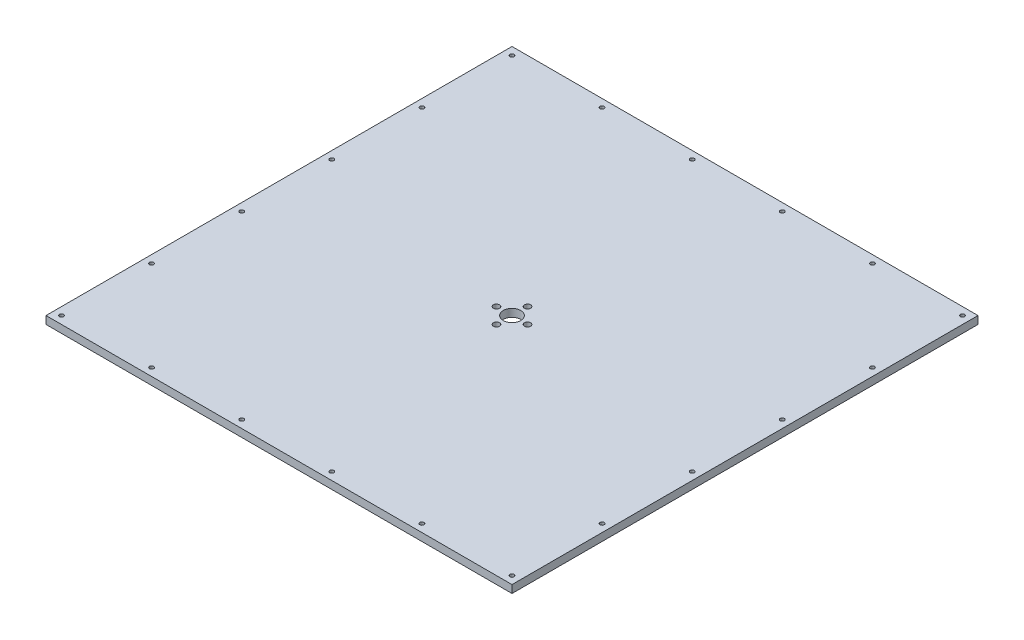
from build123d import *

# Parameters (mm, degrees)
SKETCH1_W               = 762
SKETCH1_H               = 762
BOSS_EXTRUDE1_DEPTH     = 12.7
F_1_4_CLEARANCE_HOLE1_D = 6.7564
LPATTERN1_COUNT         = 6
LPATTERN1_PITCH         = 147.32
LPATTERN1_COUNT_DIR2    = 6
LPATTERN1_PITCH_DIR2    = 147.32
SKETCH4_R               = 14.2875
CUT_EXTRUDE1_DEPTH      = 539.965017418
F_3_8_CLEARANCE_HOLE1_D = 10.0838


with BuildPart() as part:
    # Sketch1 → Boss-Extrude1 (new body)
    with BuildSketch(Plane(origin=(0, 0, 0), x_dir=(1, 0, 0), z_dir=(0, 1, 0))):
        Rectangle(SKETCH1_W, SKETCH1_H)
    extrude(amount=BOSS_EXTRUDE1_DEPTH)

    # 1_4 Clearance Hole1 (through all)
    with Locations(Plane(origin=(0, 12.7, 0), x_dir=(1, 0, 0), z_dir=(0, 1, 0))):
        with Locations((-368.3, 368.3)):
            f_1_4_clearance_hole1 = Hole(F_1_4_CLEARANCE_HOLE1_D / 2)

    # LPattern1: 1_4 Clearance Hole1 6 × 6, 16 skipped
    with Locations(*[(i * LPATTERN1_PITCH, 0, j * LPATTERN1_PITCH_DIR2) for i in range(LPATTERN1_COUNT) for j in range(LPATTERN1_COUNT_DIR2) if (i, j) not in ((0, 0), (1, 1), (1, 2), (1, 3), (1, 4), (2, 1), (2, 2), (2, 3), (2, 4), (3, 1), (3, 2), (3, 3), (3, 4), (4, 1), (4, 2), (4, 3), (4, 4))]):
        add(f_1_4_clearance_hole1, mode=Mode.SUBTRACT)

    # Sketch4 → Cut-Extrude1 (cut, through all)
    with BuildSketch(Plane(origin=(0, 12.7, 0), x_dir=(1, 0, 0), z_dir=(0, 1, 0))):
        with Locations(Location((0, 0, 0), (0, 0, 270))):
            Circle(SKETCH4_R)
    extrude(amount=-CUT_EXTRUDE1_DEPTH, mode=Mode.SUBTRACT)

    # 3_8 Clearance Hole1 (through all)
    with Locations(Plane(origin=(0, 12.7, 0), x_dir=(1, 0, 0), z_dir=(0, 1, 0))):
        with Locations((0, 25.4), (25.4, 0), (0, -25.4), (-25.4, 0)):
            Hole(F_3_8_CLEARANCE_HOLE1_D / 2)


solid = part.part
